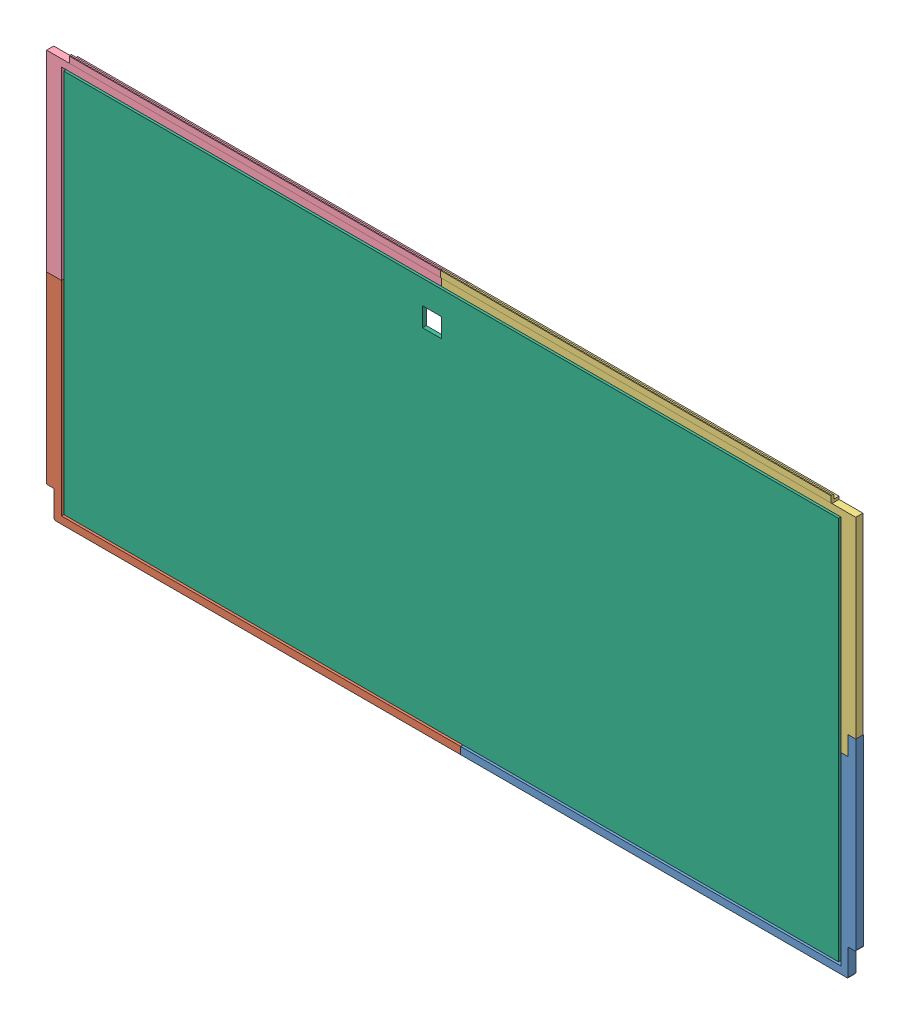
SolidWorks assembly 100099_Scheibe hinten kpl..SLDASM, configuration Standard (file format 15000). Lengths in mm.
Overall size (848 430.5 9).
6 component instances, 6 part files, 15 mates.
Components (placement in the parent):
- 100064-1: 100064.SLDPRT [Standard] at (-416 318.75 -532) x (-1 0 0) z (0 0 -1) size (434 221.25 8)
- 100066-1: 100066.SLDPRT [Standard] at (-416 318.75 -532) x (-1 0 0) z (0 0 -1) size (434 221.25 8)
- 100067-1: 100067.SLDPRT [Standard] at (-416 318.75 -532) x (1 0 0) z (0 0 -1) size (434 229.25 9)
- 100068-1: 100068.SLDPRT [Standard] at (-416 318.75 -532) x (1 0 0) z (0 0 -1) size (434 229.25 9)
- 100069-1: 100069.SLDPRT [Standard] at (-416 318.75 -536) x (-1 0 0) z (0 0 -1) size (20 382.5 4)
- 100070-1: 100070.SLDPRT [Standard] at (-416 318.75 -532) x (-1 0 0) z (0 0 -1) size (812 402.5 4)
Mates (geometry in assembly coordinates):
- Deckungsgleich212: coincident aligned: plane of 100066-1 through (-416 318.75 -540) normal (0 0 -1); plane of 100068-1 through (-416 318.75 -540) normal (0 0 -1)
- Deckungsgleich214: coincident aligned: plane of 100066-1 through (-832 107.5 -540) normal (-1 0 0); plane of 100068-1 through (-832 530 -540) normal (-1 0 0)
- Deckungsgleich215: coincident aligned: plane of 100064-1 through (-416 318.75 -540) normal (0 0 -1); plane of 100067-1 through (-416 318.75 -540) normal (0 0 -1)
- Deckungsgleich216: coincident aligned: plane of 100064-1 through (0 107.5 -540) normal (1 0 0); plane of 100067-1 through (0 530 -540) normal (1 0 0)
- Deckungsgleich221: coincident aligned: plane of 100068-1 through (-416 318.75 -540) normal (0 0 -1); plane of 100069-1 through (-416 318.75 -540) normal (0 0 -1)
- Deckungsgleich222: coincident anti-aligned: plane of 100068-1 through (-812 510 -540) normal (0 -1 0); plane of 100069-1 through (-406 510 -540) normal (0 1 0)
- Breite38: width anti-aligned: plane of 100069-1 through (-406 127.5 -540) normal (1 0 0); plane of 100069-1 through (-426 127.5 -540) normal (-1 0 0); plane of 100068-1 through (-840 328.75 -330.5489) normal (-1 0 0); plane of 100067-1 through (8 328.75 -741.4089) normal (1 0 0)
- Deckungsgleich223: coincident anti-aligned: plane of 100064-1 through (-406 107.5 -536) normal (-1 0 0); plane of 100066-1 through (-406 107.5 -532) normal (1 0 0)
- Deckungsgleich224: coincident anti-aligned: plane of 100064-1 through (-416 318.75 -536) normal (0 0 1); plane of 100066-1 through (-406 107.5 -536) normal (0 0 -1)
- Deckungsgleich225: coincident aligned: plane of 100064-1 through (0 107.5 -540) normal (0 -1 0); plane of 100066-1 through (0 107.5 -540) normal (0 -1 0)
- Deckungsgleich226: coincident anti-aligned: plane of 100064-1 through (0 308.75 -536) normal (0 1 0); plane of 100067-1 through (0 308.75 -536) normal (0 -1 0)
- Deckungsgleich227: coincident aligned: plane of 100067-1 through (-416 533 -532) normal (0 1 0); plane of 100068-1 through (-416 533 -532) normal (0 1 0)
- Deckungsgleich229: coincident anti-aligned: plane of 100068-1 through (-416 318.75 -536) normal (0 0 1); plane of 100070-1 through (-416 318.75 -536) normal (0 0 -1)
- Breite39: width aligned: plane of 100070-1 through (-10 117.5 -536) normal (1 0 0); plane of 100070-1 through (-822 117.5 -536) normal (-1 0 0); plane of 100068-1 through (-824.5 115 -536) normal (1 0 0); plane of 100064-1 through (-7.5 522.5 -536) normal (-1 0 0)
- Breite40: width aligned: plane of 100070-1 through (-10 117.5 -536) normal (0 -1 0); plane of 100070-1 through (-10 520 -536) normal (0 1 0); plane of 100067-1 through (-7.5 522.5 -536) normal (0 -1 0); plane of 100064-1 through (-824.5 115 -536) normal (0 1 0)
